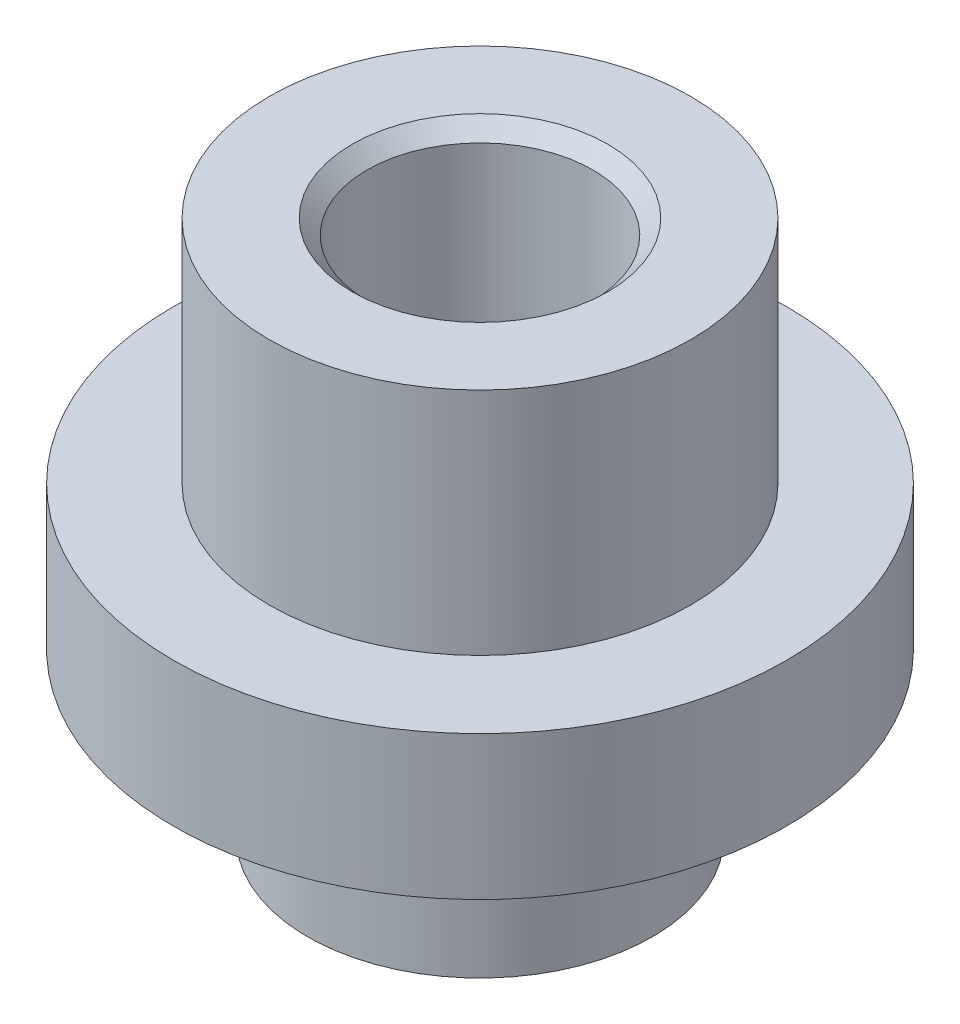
from build123d import *

# Parameters (mm, degrees)
SKICA1_R                 = 16
P_IDAT_VYSUNUT_M1_DEPTH  = 28
SKICA2_OUTSIDE_W         = 44.644
SKICA2_OUTSIDE_H         = 44.644
SKICA2_OUTSIDE_R         = 11
ODEBRAT_VYSUNUT_M1_DEPTH = 12
SKICA3_OUTSIDE_W         = 44.644
SKICA3_OUTSIDE_H         = 44.644
SKICA3_OUTSIDE_R         = 10.9
ODEBRAT_VYSUNUT_M2_DEPTH = 8.5
SKICA4_OUTSIDE_W         = 44.644
SKICA4_OUTSIDE_H         = 44.644
SKICA4_OUTSIDE_R         = 9
ODEBRAT_VYSUNUT_M3_DEPTH = 7
ZAOBLIT1_R               = 0.3
G1_4_Z_VIT1_D            = 11.8
G1_4_Z_VIT1_DEPTH        = 16
G1_4_Z_VIT1_CSINK_D      = 13.35
G1_4_Z_VIT1_CSINK_ANGLE  = 90
G1_4_Z_VIT1_TIP          = 3.406366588
SKICA7_R                 = 5
ODEBRAT_VYSUNUT_M4_DEPTH = 37


with BuildPart() as part:
    # Skica1 → P_idat vysunut_m1 (new body)
    with BuildSketch(Plane(origin=(0, 0, 0), x_dir=(1, 0, 0), z_dir=(0, 1, 0))):
        with Locations(Location((0, 0, 0), (0, 0, 270))):
            Circle(SKICA1_R)
    extrude(amount=P_IDAT_VYSUNUT_M1_DEPTH)

    # Skica2 outside → Odebrat vysunut_m1 (cut)
    with BuildSketch(Plane(origin=(0, 28, 0), x_dir=(1, 0, 0), z_dir=(0, 1, 0))):
        Rectangle(SKICA2_OUTSIDE_W, SKICA2_OUTSIDE_H)
        with Locations(Location((0, 0, 0), (0, 0, 270))):
            Circle(SKICA2_OUTSIDE_R, mode=Mode.SUBTRACT)
    extrude(amount=-ODEBRAT_VYSUNUT_M1_DEPTH, mode=Mode.SUBTRACT)

    # Skica3 outside → Odebrat vysunut_m2 (cut)
    with BuildSketch(Plane.XZ):
        Rectangle(SKICA3_OUTSIDE_W, SKICA3_OUTSIDE_H)
        with Locations(Location((0, 0, 0), (0, 0, 270))):
            Circle(SKICA3_OUTSIDE_R, mode=Mode.SUBTRACT)
    extrude(amount=-ODEBRAT_VYSUNUT_M2_DEPTH, mode=Mode.SUBTRACT)

    # Skica4 outside → Odebrat vysunut_m3 (cut)
    with BuildSketch(Plane.XZ):
        Rectangle(SKICA4_OUTSIDE_W, SKICA4_OUTSIDE_H)
        with Locations(Location((0, 0, 0), (0, 0, 270))):
            Circle(SKICA4_OUTSIDE_R, mode=Mode.SUBTRACT)
    extrude(amount=-ODEBRAT_VYSUNUT_M3_DEPTH, mode=Mode.SUBTRACT)

    # Zaoblit1
    zaoblit1_edges = [part.edges().sort_by_distance(p)[0] for p in [
        (0, 8.5, 10.9),
    ]]
    fillet(zaoblit1_edges, radius=ZAOBLIT1_R)

    # G1_4 z_vit1
    with Locations(Plane(origin=(0, 28, 0), x_dir=(-1, 0, 0), z_dir=(0, 1, 0))):
        with Locations((0, 0)):
            CounterSinkHole(G1_4_Z_VIT1_D / 2, G1_4_Z_VIT1_CSINK_D / 2, depth=G1_4_Z_VIT1_DEPTH, counter_sink_angle=G1_4_Z_VIT1_CSINK_ANGLE)
            with Locations((0, 0, -(G1_4_Z_VIT1_DEPTH + G1_4_Z_VIT1_TIP / 2))):  # 120° drill point
                Cone(0, G1_4_Z_VIT1_D / 2, G1_4_Z_VIT1_TIP, mode=Mode.SUBTRACT)

    # Skica7 → Odebrat vysunut_m4 (cut, through all)
    with BuildSketch(Plane.XZ):
        with Locations(Location((0, 0, 0), (0, 0, 270))):
            Circle(SKICA7_R)
    extrude(amount=-ODEBRAT_VYSUNUT_M4_DEPTH, mode=Mode.SUBTRACT)


solid = part.part
